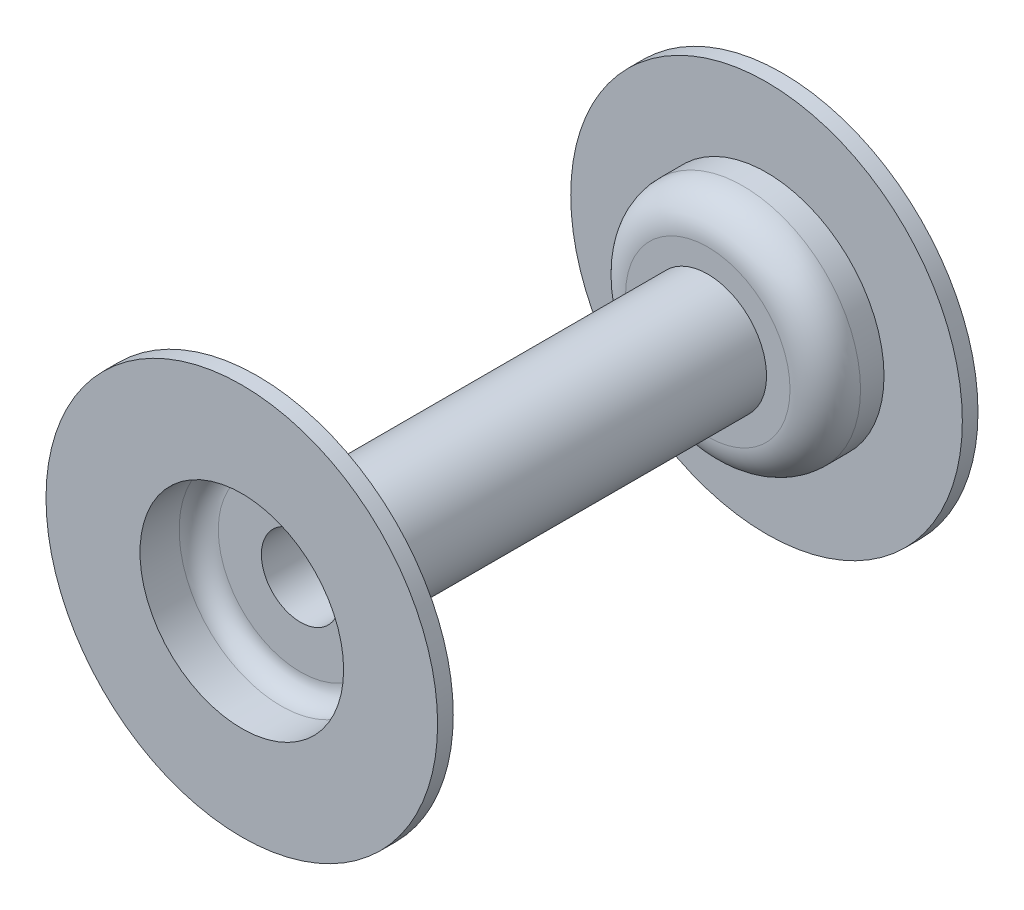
ISO-10303-21;
HEADER;
FILE_DESCRIPTION(('STEP AP214'),'2;1');
FILE_NAME('part.step','',(''),(''),'','','');
FILE_SCHEMA(('AUTOMOTIVE_DESIGN { 1 0 10303 214 1 1 1 1 }'));
ENDSEC;
DATA;
#1=APPLICATION_CONTEXT('core data for automotive mechanical design processes');
#2=APPLICATION_PROTOCOL_DEFINITION('international standard','automotive_design',2000,#1);
#3=PRODUCT_CONTEXT('',#1,'mechanical');
#4=PRODUCT('Part','Part','',(#3));
#5=PRODUCT_RELATED_PRODUCT_CATEGORY('part','',(#4));
#6=PRODUCT_DEFINITION_FORMATION('','',#4);
#7=PRODUCT_DEFINITION_CONTEXT('part definition',#1,'design');
#8=PRODUCT_DEFINITION('design','',#6,#7);
#9=PRODUCT_DEFINITION_SHAPE('','',#8);
#10=(LENGTH_UNIT() NAMED_UNIT(*) SI_UNIT(.MILLI.,.METRE.));
#11=(NAMED_UNIT(*) PLANE_ANGLE_UNIT() SI_UNIT($,.RADIAN.));
#12=(NAMED_UNIT(*) SI_UNIT($,.STERADIAN.) SOLID_ANGLE_UNIT());
#13=UNCERTAINTY_MEASURE_WITH_UNIT(LENGTH_MEASURE(1.E-05),#10,'distance_accuracy_value','');
#14=(GEOMETRIC_REPRESENTATION_CONTEXT(3) GLOBAL_UNCERTAINTY_ASSIGNED_CONTEXT((#13)) GLOBAL_UNIT_ASSIGNED_CONTEXT((#10,
#11,#12)) REPRESENTATION_CONTEXT('',''));
#15=CARTESIAN_POINT('',(0.,0.,0.));
#16=DIRECTION('',(0.,0.,1.));
#17=DIRECTION('',(1.,0.,0.));
#18=AXIS2_PLACEMENT_3D('',#15,#16,#17);
#19=CARTESIAN_POINT('',(0.,0.,25.));
#20=DIRECTION('',(0.,0.,-1.));
#21=DIRECTION('',(-1.,0.,0.));
#22=AXIS2_PLACEMENT_3D('',#19,#20,#21);
#23=CYLINDRICAL_SURFACE('',#22,7.5);
#24=CARTESIAN_POINT('',(0.,0.,25.));
#25=DIRECTION('',(0.,0.,1.));
#26=DIRECTION('',(1.,0.,0.));
#27=AXIS2_PLACEMENT_3D('',#24,#25,#26);
#28=CIRCLE('',#27,7.5);
#29=CARTESIAN_POINT('',(7.5,0.,25.));
#30=VERTEX_POINT('',#29);
#31=EDGE_CURVE('E10',#30,#30,#28,.T.);
#32=ORIENTED_EDGE('',*,*,#31,.F.);
#33=EDGE_LOOP('',(#32));
#34=FACE_BOUND('',#33,.T.);
#35=CARTESIAN_POINT('',(0.,0.,-25.));
#36=DIRECTION('',(0.,0.,-1.));
#37=DIRECTION('',(-1.,0.,0.));
#38=AXIS2_PLACEMENT_3D('',#35,#36,#37);
#39=CIRCLE('',#38,7.5);
#40=CARTESIAN_POINT('',(-7.5,0.,-25.));
#41=VERTEX_POINT('',#40);
#42=EDGE_CURVE('E68',#41,#41,#39,.T.);
#43=ORIENTED_EDGE('',*,*,#42,.F.);
#44=EDGE_LOOP('',(#43));
#45=FACE_BOUND('',#44,.T.);
#46=ADVANCED_FACE('F34',(#34,#45),#23,.T.);
#47=CARTESIAN_POINT('',(0.,0.,25.));
#48=DIRECTION('',(0.,0.,1.));
#49=DIRECTION('',(1.,0.,0.));
#50=AXIS2_PLACEMENT_3D('',#47,#48,#49);
#51=PLANE('',#50);
#52=CARTESIAN_POINT('',(0.,0.,25.));
#53=DIRECTION('',(0.,0.,1.));
#54=DIRECTION('',(1.,0.,0.));
#55=AXIS2_PLACEMENT_3D('',#52,#53,#54);
#56=CIRCLE('',#55,10.5);
#57=CARTESIAN_POINT('',(10.5,0.,25.));
#58=VERTEX_POINT('',#57);
#59=EDGE_CURVE('E50',#58,#58,#56,.T.);
#60=ORIENTED_EDGE('',*,*,#59,.F.);
#61=EDGE_LOOP('',(#60));
#62=FACE_BOUND('',#61,.T.);
#63=ORIENTED_EDGE('',*,*,#31,.T.);
#64=EDGE_LOOP('',(#63));
#65=FACE_BOUND('',#64,.T.);
#66=ADVANCED_FACE('F118',(#62,#65),#51,.F.);
#67=CARTESIAN_POINT('',(0.,0.,25.));
#68=DIRECTION('',(0.,0.,1.));
#69=DIRECTION('',(1.,0.,0.));
#70=AXIS2_PLACEMENT_3D('',#67,#68,#69);
#71=CYLINDRICAL_SURFACE('',#70,15.);
#72=CARTESIAN_POINT('',(0.,0.,32.5));
#73=DIRECTION('',(0.,0.,1.));
#74=DIRECTION('',(1.,0.,0.));
#75=AXIS2_PLACEMENT_3D('',#72,#73,#74);
#76=CIRCLE('',#75,15.);
#77=CARTESIAN_POINT('',(15.,0.,32.5));
#78=VERTEX_POINT('',#77);
#79=EDGE_CURVE('E41',#78,#78,#76,.T.);
#80=ORIENTED_EDGE('',*,*,#79,.F.);
#81=EDGE_LOOP('',(#80));
#82=FACE_BOUND('',#81,.T.);
#83=CARTESIAN_POINT('',(0.,0.,29.5));
#84=DIRECTION('',(0.,0.,1.));
#85=DIRECTION('',(1.,0.,0.));
#86=AXIS2_PLACEMENT_3D('',#83,#84,#85);
#87=CIRCLE('',#86,15.);
#88=CARTESIAN_POINT('',(15.,0.,29.5));
#89=VERTEX_POINT('',#88);
#90=EDGE_CURVE('E45',#89,#89,#87,.T.);
#91=ORIENTED_EDGE('',*,*,#90,.T.);
#92=EDGE_LOOP('',(#91));
#93=FACE_BOUND('',#92,.T.);
#94=ADVANCED_FACE('F123',(#82,#93),#71,.T.);
#95=CARTESIAN_POINT('',(0.,0.,29.5));
#96=DIRECTION('',(0.,0.,1.));
#97=DIRECTION('',(1.,0.,0.));
#98=AXIS2_PLACEMENT_3D('',#95,#96,#97);
#99=TOROIDAL_SURFACE('',#98,10.5,4.5);
#100=ORIENTED_EDGE('',*,*,#90,.F.);
#101=EDGE_LOOP('',(#100));
#102=FACE_BOUND('',#101,.T.);
#103=ORIENTED_EDGE('',*,*,#59,.T.);
#104=EDGE_LOOP('',(#103));
#105=FACE_BOUND('',#104,.T.);
#106=ADVANCED_FACE('F160',(#102,#105),#99,.T.);
#107=CARTESIAN_POINT('',(0.,0.,32.5));
#108=DIRECTION('',(0.,0.,1.));
#109=DIRECTION('',(1.,0.,0.));
#110=AXIS2_PLACEMENT_3D('',#107,#108,#109);
#111=PLANE('',#110);
#112=CARTESIAN_POINT('',(0.,0.,32.5));
#113=DIRECTION('',(0.,0.,1.));
#114=DIRECTION('',(1.,0.,0.));
#115=AXIS2_PLACEMENT_3D('',#112,#113,#114);
#116=CIRCLE('',#115,25.);
#117=CARTESIAN_POINT('',(25.,0.,32.5));
#118=VERTEX_POINT('',#117);
#119=EDGE_CURVE('E60',#118,#118,#116,.T.);
#120=ORIENTED_EDGE('',*,*,#119,.F.);
#121=EDGE_LOOP('',(#120));
#122=FACE_BOUND('',#121,.T.);
#123=ORIENTED_EDGE('',*,*,#79,.T.);
#124=EDGE_LOOP('',(#123));
#125=FACE_BOUND('',#124,.T.);
#126=ADVANCED_FACE('F156',(#122,#125),#111,.F.);
#127=CARTESIAN_POINT('',(0.,0.,34.5));
#128=DIRECTION('',(0.,0.,1.));
#129=DIRECTION('',(1.,0.,0.));
#130=AXIS2_PLACEMENT_3D('',#127,#128,#129);
#131=PLANE('',#130);
#132=CARTESIAN_POINT('',(0.,0.,34.5));
#133=DIRECTION('',(0.,0.,1.));
#134=DIRECTION('',(1.,0.,0.));
#135=AXIS2_PLACEMENT_3D('',#132,#133,#134);
#136=CIRCLE('',#135,25.);
#137=CARTESIAN_POINT('',(25.,0.,34.5));
#138=VERTEX_POINT('',#137);
#139=EDGE_CURVE('E59',#138,#138,#136,.T.);
#140=ORIENTED_EDGE('',*,*,#139,.T.);
#141=EDGE_LOOP('',(#140));
#142=FACE_BOUND('',#141,.T.);
#143=CARTESIAN_POINT('',(0.,0.,34.5));
#144=DIRECTION('',(0.,0.,1.));
#145=DIRECTION('',(1.,0.,0.));
#146=AXIS2_PLACEMENT_3D('',#143,#144,#145);
#147=CIRCLE('',#146,13.);
#148=CARTESIAN_POINT('',(13.,0.,34.5));
#149=VERTEX_POINT('',#148);
#150=EDGE_CURVE('E63',#149,#149,#147,.T.);
#151=ORIENTED_EDGE('',*,*,#150,.F.);
#152=EDGE_LOOP('',(#151));
#153=FACE_BOUND('',#152,.T.);
#154=ADVANCED_FACE('F152',(#142,#153),#131,.T.);
#155=CARTESIAN_POINT('',(0.,0.,34.5));
#156=DIRECTION('',(0.,0.,-1.));
#157=DIRECTION('',(-1.,0.,0.));
#158=AXIS2_PLACEMENT_3D('',#155,#156,#157);
#159=CYLINDRICAL_SURFACE('',#158,25.);
#160=ORIENTED_EDGE('',*,*,#139,.F.);
#161=EDGE_LOOP('',(#160));
#162=FACE_BOUND('',#161,.T.);
#163=ORIENTED_EDGE('',*,*,#119,.T.);
#164=EDGE_LOOP('',(#163));
#165=FACE_BOUND('',#164,.T.);
#166=ADVANCED_FACE('F155',(#162,#165),#159,.T.);
#167=CARTESIAN_POINT('',(0.,0.,27.));
#168=DIRECTION('',(0.,0.,-1.));
#169=DIRECTION('',(-1.,0.,0.));
#170=AXIS2_PLACEMENT_3D('',#167,#168,#169);
#171=PLANE('',#170);
#172=CARTESIAN_POINT('',(0.,0.,27.));
#173=DIRECTION('',(0.,0.,-1.));
#174=DIRECTION('',(-1.,0.,0.));
#175=AXIS2_PLACEMENT_3D('',#172,#173,#174);
#176=CIRCLE('',#175,5.);
#177=CARTESIAN_POINT('',(-5.,0.,27.));
#178=VERTEX_POINT('',#177);
#179=EDGE_CURVE('E95',#178,#178,#176,.T.);
#180=ORIENTED_EDGE('',*,*,#179,.T.);
#181=EDGE_LOOP('',(#180));
#182=FACE_BOUND('',#181,.T.);
#183=CARTESIAN_POINT('',(0.,0.,27.));
#184=DIRECTION('',(0.,0.,1.));
#185=DIRECTION('',(1.,0.,0.));
#186=AXIS2_PLACEMENT_3D('',#183,#184,#185);
#187=CIRCLE('',#186,10.5);
#188=CARTESIAN_POINT('',(10.5,0.,27.));
#189=VERTEX_POINT('',#188);
#190=EDGE_CURVE('E53',#189,#189,#187,.T.);
#191=ORIENTED_EDGE('',*,*,#190,.T.);
#192=EDGE_LOOP('',(#191));
#193=FACE_BOUND('',#192,.T.);
#194=ADVANCED_FACE('F163',(#182,#193),#171,.F.);
#195=CARTESIAN_POINT('',(0.,0.,29.5));
#196=DIRECTION('',(0.,0.,1.));
#197=DIRECTION('',(1.,0.,0.));
#198=AXIS2_PLACEMENT_3D('',#195,#196,#197);
#199=TOROIDAL_SURFACE('',#198,10.5,2.5);
#200=ORIENTED_EDGE('',*,*,#190,.F.);
#201=EDGE_LOOP('',(#200));
#202=FACE_BOUND('',#201,.T.);
#203=CARTESIAN_POINT('',(0.,0.,29.5));
#204=DIRECTION('',(0.,0.,1.));
#205=DIRECTION('',(1.,0.,0.));
#206=AXIS2_PLACEMENT_3D('',#203,#204,#205);
#207=CIRCLE('',#206,13.);
#208=CARTESIAN_POINT('',(13.,0.,29.5));
#209=VERTEX_POINT('',#208);
#210=EDGE_CURVE('E56',#209,#209,#207,.T.);
#211=ORIENTED_EDGE('',*,*,#210,.T.);
#212=EDGE_LOOP('',(#211));
#213=FACE_BOUND('',#212,.T.);
#214=ADVANCED_FACE('F142',(#202,#213),#199,.F.);
#215=CARTESIAN_POINT('',(0.,0.,25.));
#216=DIRECTION('',(0.,0.,1.));
#217=DIRECTION('',(1.,0.,0.));
#218=AXIS2_PLACEMENT_3D('',#215,#216,#217);
#219=CYLINDRICAL_SURFACE('',#218,13.);
#220=ORIENTED_EDGE('',*,*,#210,.F.);
#221=EDGE_LOOP('',(#220));
#222=FACE_BOUND('',#221,.T.);
#223=ORIENTED_EDGE('',*,*,#150,.T.);
#224=EDGE_LOOP('',(#223));
#225=FACE_BOUND('',#224,.T.);
#226=ADVANCED_FACE('F132',(#222,#225),#219,.F.);
#227=CARTESIAN_POINT('',(0.,0.,-25.));
#228=DIRECTION('',(0.,0.,-1.));
#229=DIRECTION('',(1.,0.,0.));
#230=AXIS2_PLACEMENT_3D('',#227,#228,#229);
#231=PLANE('',#230);
#232=CARTESIAN_POINT('',(0.,0.,-25.));
#233=DIRECTION('',(0.,0.,1.));
#234=DIRECTION('',(1.,0.,0.));
#235=AXIS2_PLACEMENT_3D('',#232,#233,#234);
#236=CIRCLE('',#235,10.5);
#237=CARTESIAN_POINT('',(10.5,0.,-25.));
#238=VERTEX_POINT('',#237);
#239=EDGE_CURVE('E74',#238,#238,#236,.T.);
#240=ORIENTED_EDGE('',*,*,#239,.T.);
#241=EDGE_LOOP('',(#240));
#242=FACE_BOUND('',#241,.T.);
#243=ORIENTED_EDGE('',*,*,#42,.T.);
#244=EDGE_LOOP('',(#243));
#245=FACE_BOUND('',#244,.T.);
#246=ADVANCED_FACE('F129',(#242,#245),#231,.F.);
#247=CARTESIAN_POINT('',(0.,0.,-25.));
#248=DIRECTION('',(0.,0.,-1.));
#249=DIRECTION('',(1.,0.,0.));
#250=AXIS2_PLACEMENT_3D('',#247,#248,#249);
#251=CYLINDRICAL_SURFACE('',#250,15.);
#252=CARTESIAN_POINT('',(0.,0.,-32.5));
#253=DIRECTION('',(0.,0.,-1.));
#254=DIRECTION('',(-1.,0.,0.));
#255=AXIS2_PLACEMENT_3D('',#252,#253,#254);
#256=CIRCLE('',#255,15.);
#257=CARTESIAN_POINT('',(-15.,0.,-32.5));
#258=VERTEX_POINT('',#257);
#259=EDGE_CURVE('E83',#258,#258,#256,.T.);
#260=ORIENTED_EDGE('',*,*,#259,.F.);
#261=EDGE_LOOP('',(#260));
#262=FACE_BOUND('',#261,.T.);
#263=CARTESIAN_POINT('',(0.,0.,-29.5));
#264=DIRECTION('',(0.,0.,1.));
#265=DIRECTION('',(1.,0.,0.));
#266=AXIS2_PLACEMENT_3D('',#263,#264,#265);
#267=CIRCLE('',#266,15.);
#268=CARTESIAN_POINT('',(15.,0.,-29.5));
#269=VERTEX_POINT('',#268);
#270=EDGE_CURVE('E71',#269,#269,#267,.T.);
#271=ORIENTED_EDGE('',*,*,#270,.F.);
#272=EDGE_LOOP('',(#271));
#273=FACE_BOUND('',#272,.T.);
#274=ADVANCED_FACE('F131',(#262,#273),#251,.T.);
#275=CARTESIAN_POINT('',(0.,0.,-29.5));
#276=DIRECTION('',(0.,0.,-1.));
#277=DIRECTION('',(1.,0.,0.));
#278=AXIS2_PLACEMENT_3D('',#275,#276,#277);
#279=TOROIDAL_SURFACE('',#278,10.5,4.5);
#280=ORIENTED_EDGE('',*,*,#270,.T.);
#281=EDGE_LOOP('',(#280));
#282=FACE_BOUND('',#281,.T.);
#283=ORIENTED_EDGE('',*,*,#239,.F.);
#284=EDGE_LOOP('',(#283));
#285=FACE_BOUND('',#284,.T.);
#286=ADVANCED_FACE('F139',(#282,#285),#279,.T.);
#287=CARTESIAN_POINT('',(0.,0.,-32.5));
#288=DIRECTION('',(0.,0.,-1.));
#289=DIRECTION('',(1.,0.,0.));
#290=AXIS2_PLACEMENT_3D('',#287,#288,#289);
#291=PLANE('',#290);
#292=CARTESIAN_POINT('',(0.,0.,-32.5));
#293=DIRECTION('',(0.,0.,1.));
#294=DIRECTION('',(1.,0.,0.));
#295=AXIS2_PLACEMENT_3D('',#292,#293,#294);
#296=CIRCLE('',#295,25.);
#297=CARTESIAN_POINT('',(25.,0.,-32.5));
#298=VERTEX_POINT('',#297);
#299=EDGE_CURVE('E87',#298,#298,#296,.T.);
#300=ORIENTED_EDGE('',*,*,#299,.T.);
#301=EDGE_LOOP('',(#300));
#302=FACE_BOUND('',#301,.T.);
#303=ORIENTED_EDGE('',*,*,#259,.T.);
#304=EDGE_LOOP('',(#303));
#305=FACE_BOUND('',#304,.T.);
#306=ADVANCED_FACE('F149',(#302,#305),#291,.F.);
#307=CARTESIAN_POINT('',(0.,0.,-34.5));
#308=DIRECTION('',(0.,0.,1.));
#309=DIRECTION('',(1.,0.,0.));
#310=AXIS2_PLACEMENT_3D('',#307,#308,#309);
#311=CYLINDRICAL_SURFACE('',#310,25.);
#312=CARTESIAN_POINT('',(0.,0.,-34.5));
#313=DIRECTION('',(0.,0.,1.));
#314=DIRECTION('',(1.,0.,0.));
#315=AXIS2_PLACEMENT_3D('',#312,#313,#314);
#316=CIRCLE('',#315,25.);
#317=CARTESIAN_POINT('',(25.,0.,-34.5));
#318=VERTEX_POINT('',#317);
#319=EDGE_CURVE('E86',#318,#318,#316,.T.);
#320=ORIENTED_EDGE('',*,*,#319,.T.);
#321=EDGE_LOOP('',(#320));
#322=FACE_BOUND('',#321,.T.);
#323=ORIENTED_EDGE('',*,*,#299,.F.);
#324=EDGE_LOOP('',(#323));
#325=FACE_BOUND('',#324,.T.);
#326=ADVANCED_FACE('F248',(#322,#325),#311,.T.);
#327=CARTESIAN_POINT('',(0.,0.,-34.5));
#328=DIRECTION('',(0.,0.,-1.));
#329=DIRECTION('',(1.,0.,0.));
#330=AXIS2_PLACEMENT_3D('',#327,#328,#329);
#331=PLANE('',#330);
#332=CARTESIAN_POINT('',(0.,0.,-34.5));
#333=DIRECTION('',(0.,0.,1.));
#334=DIRECTION('',(1.,0.,0.));
#335=AXIS2_PLACEMENT_3D('',#332,#333,#334);
#336=CIRCLE('',#335,13.);
#337=CARTESIAN_POINT('',(13.,0.,-34.5));
#338=VERTEX_POINT('',#337);
#339=EDGE_CURVE('E90',#338,#338,#336,.T.);
#340=ORIENTED_EDGE('',*,*,#339,.T.);
#341=EDGE_LOOP('',(#340));
#342=FACE_BOUND('',#341,.T.);
#343=ORIENTED_EDGE('',*,*,#319,.F.);
#344=EDGE_LOOP('',(#343));
#345=FACE_BOUND('',#344,.T.);
#346=ADVANCED_FACE('F262',(#342,#345),#331,.T.);
#347=CARTESIAN_POINT('',(0.,0.,-27.));
#348=DIRECTION('',(0.,0.,1.));
#349=DIRECTION('',(-1.,0.,0.));
#350=AXIS2_PLACEMENT_3D('',#347,#348,#349);
#351=PLANE('',#350);
#352=CARTESIAN_POINT('',(0.,0.,-27.));
#353=DIRECTION('',(0.,0.,1.));
#354=DIRECTION('',(1.,0.,0.));
#355=AXIS2_PLACEMENT_3D('',#352,#353,#354);
#356=CIRCLE('',#355,5.);
#357=CARTESIAN_POINT('',(5.,0.,-27.));
#358=VERTEX_POINT('',#357);
#359=EDGE_CURVE('E37',#358,#358,#356,.T.);
#360=ORIENTED_EDGE('',*,*,#359,.T.);
#361=EDGE_LOOP('',(#360));
#362=FACE_BOUND('',#361,.T.);
#363=CARTESIAN_POINT('',(0.,0.,-27.));
#364=DIRECTION('',(0.,0.,1.));
#365=DIRECTION('',(1.,0.,0.));
#366=AXIS2_PLACEMENT_3D('',#363,#364,#365);
#367=CIRCLE('',#366,10.5);
#368=CARTESIAN_POINT('',(10.5,0.,-27.));
#369=VERTEX_POINT('',#368);
#370=EDGE_CURVE('E77',#369,#369,#367,.T.);
#371=ORIENTED_EDGE('',*,*,#370,.F.);
#372=EDGE_LOOP('',(#371));
#373=FACE_BOUND('',#372,.T.);
#374=ADVANCED_FACE('F102',(#362,#373),#351,.F.);
#375=CARTESIAN_POINT('',(0.,0.,-29.5));
#376=DIRECTION('',(0.,0.,-1.));
#377=DIRECTION('',(1.,0.,0.));
#378=AXIS2_PLACEMENT_3D('',#375,#376,#377);
#379=TOROIDAL_SURFACE('',#378,10.5,2.5);
#380=ORIENTED_EDGE('',*,*,#370,.T.);
#381=EDGE_LOOP('',(#380));
#382=FACE_BOUND('',#381,.T.);
#383=CARTESIAN_POINT('',(0.,0.,-29.5));
#384=DIRECTION('',(0.,0.,1.));
#385=DIRECTION('',(1.,0.,0.));
#386=AXIS2_PLACEMENT_3D('',#383,#384,#385);
#387=CIRCLE('',#386,13.);
#388=CARTESIAN_POINT('',(13.,0.,-29.5));
#389=VERTEX_POINT('',#388);
#390=EDGE_CURVE('E80',#389,#389,#387,.T.);
#391=ORIENTED_EDGE('',*,*,#390,.F.);
#392=EDGE_LOOP('',(#391));
#393=FACE_BOUND('',#392,.T.);
#394=ADVANCED_FACE('F113',(#382,#393),#379,.F.);
#395=CARTESIAN_POINT('',(0.,0.,-25.));
#396=DIRECTION('',(0.,0.,-1.));
#397=DIRECTION('',(1.,0.,0.));
#398=AXIS2_PLACEMENT_3D('',#395,#396,#397);
#399=CYLINDRICAL_SURFACE('',#398,13.);
#400=ORIENTED_EDGE('',*,*,#390,.T.);
#401=EDGE_LOOP('',(#400));
#402=FACE_BOUND('',#401,.T.);
#403=ORIENTED_EDGE('',*,*,#339,.F.);
#404=EDGE_LOOP('',(#403));
#405=FACE_BOUND('',#404,.T.);
#406=ADVANCED_FACE('F108',(#402,#405),#399,.F.);
#407=CARTESIAN_POINT('',(0.,0.,-34.5));
#408=DIRECTION('',(0.,0.,1.));
#409=DIRECTION('',(1.,0.,0.));
#410=AXIS2_PLACEMENT_3D('',#407,#408,#409);
#411=CYLINDRICAL_SURFACE('',#410,5.);
#412=ORIENTED_EDGE('',*,*,#359,.F.);
#413=EDGE_LOOP('',(#412));
#414=FACE_BOUND('',#413,.T.);
#415=ORIENTED_EDGE('',*,*,#179,.F.);
#416=EDGE_LOOP('',(#415));
#417=FACE_BOUND('',#416,.T.);
#418=ADVANCED_FACE('F105',(#414,#417),#411,.F.);
#419=CLOSED_SHELL('',(#46,#66,#94,#106,#126,#154,#166,#194,#214,#226,#246,#274,#286,#306,#326,
#346,#374,#394,#406,#418));
#420=MANIFOLD_SOLID_BREP('B2',#419);
#421=ADVANCED_BREP_SHAPE_REPRESENTATION('',(#18,#420),#14);
#422=SHAPE_DEFINITION_REPRESENTATION(#9,#421);
ENDSEC;
END-ISO-10303-21;
